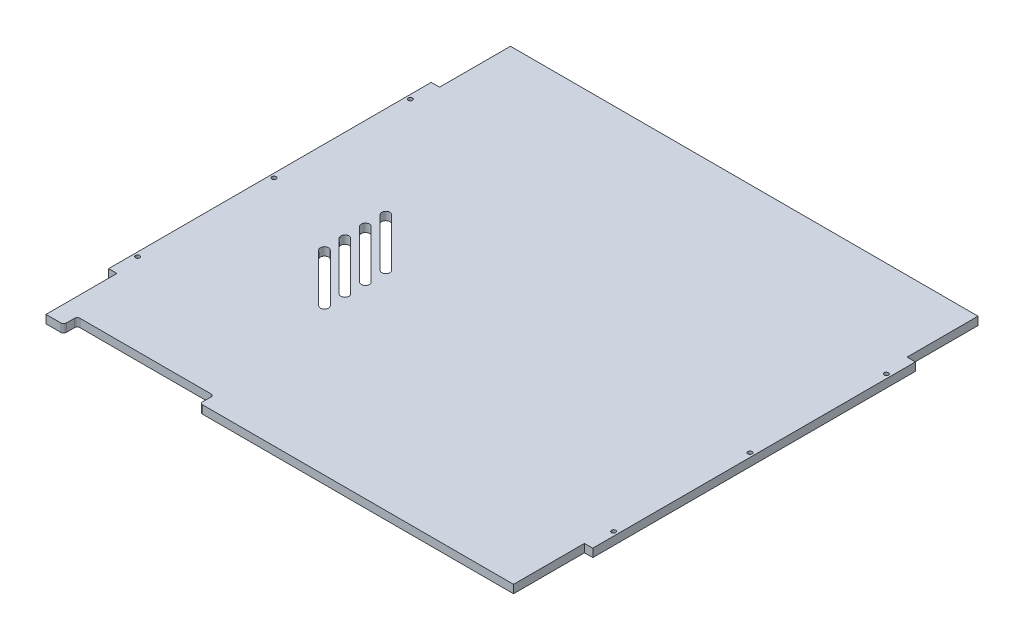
ISO-10303-21;
HEADER;
FILE_DESCRIPTION(('STEP AP214'),'2;1');
FILE_NAME('part.step','',(''),(''),'','','');
FILE_SCHEMA(('AUTOMOTIVE_DESIGN { 1 0 10303 214 1 1 1 1 }'));
ENDSEC;
DATA;
#1=APPLICATION_CONTEXT('core data for automotive mechanical design processes');
#2=APPLICATION_PROTOCOL_DEFINITION('international standard','automotive_design',2000,#1);
#3=PRODUCT_CONTEXT('',#1,'mechanical');
#4=PRODUCT('Part','Part','',(#3));
#5=PRODUCT_RELATED_PRODUCT_CATEGORY('part','',(#4));
#6=PRODUCT_DEFINITION_FORMATION('','',#4);
#7=PRODUCT_DEFINITION_CONTEXT('part definition',#1,'design');
#8=PRODUCT_DEFINITION('design','',#6,#7);
#9=PRODUCT_DEFINITION_SHAPE('','',#8);
#10=(LENGTH_UNIT() NAMED_UNIT(*) SI_UNIT(.MILLI.,.METRE.));
#11=(NAMED_UNIT(*) PLANE_ANGLE_UNIT() SI_UNIT($,.RADIAN.));
#12=(NAMED_UNIT(*) SI_UNIT($,.STERADIAN.) SOLID_ANGLE_UNIT());
#13=UNCERTAINTY_MEASURE_WITH_UNIT(LENGTH_MEASURE(1.E-05),#10,'distance_accuracy_value','');
#14=(GEOMETRIC_REPRESENTATION_CONTEXT(3) GLOBAL_UNCERTAINTY_ASSIGNED_CONTEXT((#13)) GLOBAL_UNIT_ASSIGNED_CONTEXT((#10,
#11,#12)) REPRESENTATION_CONTEXT('',''));
#15=CARTESIAN_POINT('',(0.,0.,0.));
#16=DIRECTION('',(0.,0.,1.));
#17=DIRECTION('',(1.,0.,0.));
#18=AXIS2_PLACEMENT_3D('',#15,#16,#17);
#19=CARTESIAN_POINT('',(-177.475,6.,170.25));
#20=DIRECTION('',(0.,0.,-1.));
#21=DIRECTION('',(-1.,0.,0.));
#22=AXIS2_PLACEMENT_3D('',#19,#20,#21);
#23=PLANE('',#22);
#24=DIRECTION('',(1.,0.,0.));
#25=VECTOR('',#24,1.);
#26=CARTESIAN_POINT('',(-177.475,0.,170.25));
#27=LINE('',#26,#25);
#28=CARTESIAN_POINT('',(-171.375,0.,170.25));
#29=VERTEX_POINT('',#28);
#30=CARTESIAN_POINT('',(-160.475,0.,170.25));
#31=VERTEX_POINT('',#30);
#32=EDGE_CURVE('E520',#29,#31,#27,.T.);
#33=ORIENTED_EDGE('',*,*,#32,.T.);
#34=DIRECTION('',(0.,1.,0.));
#35=VECTOR('',#34,1.);
#36=CARTESIAN_POINT('',(-160.475,6.,170.25));
#37=LINE('',#36,#35);
#38=CARTESIAN_POINT('',(-160.475,6.,170.25));
#39=VERTEX_POINT('',#38);
#40=EDGE_CURVE('E540',#31,#39,#37,.T.);
#41=ORIENTED_EDGE('',*,*,#40,.T.);
#42=DIRECTION('',(1.,0.,0.));
#43=VECTOR('',#42,1.);
#44=CARTESIAN_POINT('',(-177.475,6.,170.25));
#45=LINE('',#44,#43);
#46=CARTESIAN_POINT('',(-171.375,6.,170.25));
#47=VERTEX_POINT('',#46);
#48=EDGE_CURVE('E507',#47,#39,#45,.T.);
#49=ORIENTED_EDGE('',*,*,#48,.F.);
#50=DIRECTION('',(0.,1.,0.));
#51=VECTOR('',#50,1.);
#52=CARTESIAN_POINT('',(-171.375,0.,170.25));
#53=LINE('',#52,#51);
#54=EDGE_CURVE('E420',#29,#47,#53,.T.);
#55=ORIENTED_EDGE('',*,*,#54,.F.);
#56=EDGE_LOOP('',(#33,#41,#49,#55));
#57=FACE_BOUND('',#56,.T.);
#58=ADVANCED_FACE('F34',(#57),#23,.F.);
#59=CARTESIAN_POINT('',(-177.475,6.,-170.25));
#60=DIRECTION('',(1.,0.,0.));
#61=DIRECTION('',(0.,0.,-1.));
#62=AXIS2_PLACEMENT_3D('',#59,#60,#61);
#63=PLANE('',#62);
#64=DIRECTION('',(0.,0.,1.));
#65=VECTOR('',#64,1.);
#66=CARTESIAN_POINT('',(-177.475,0.,-170.25));
#67=LINE('',#66,#65);
#68=CARTESIAN_POINT('',(-177.475,0.,-118.25));
#69=VERTEX_POINT('',#68);
#70=CARTESIAN_POINT('',(-177.475,0.,118.25));
#71=VERTEX_POINT('',#70);
#72=EDGE_CURVE('E495',#69,#71,#67,.T.);
#73=ORIENTED_EDGE('',*,*,#72,.T.);
#74=DIRECTION('',(0.,1.,0.));
#75=VECTOR('',#74,1.);
#76=CARTESIAN_POINT('',(-177.475,0.,118.25));
#77=LINE('',#76,#75);
#78=CARTESIAN_POINT('',(-177.475,6.,118.25));
#79=VERTEX_POINT('',#78);
#80=EDGE_CURVE('E424',#71,#79,#77,.T.);
#81=ORIENTED_EDGE('',*,*,#80,.T.);
#82=DIRECTION('',(0.,0.,1.));
#83=VECTOR('',#82,1.);
#84=CARTESIAN_POINT('',(-177.475,6.,-170.25));
#85=LINE('',#84,#83);
#86=CARTESIAN_POINT('',(-177.475,6.,-118.25));
#87=VERTEX_POINT('',#86);
#88=EDGE_CURVE('E502',#87,#79,#85,.T.);
#89=ORIENTED_EDGE('',*,*,#88,.F.);
#90=DIRECTION('',(0.,1.,0.));
#91=VECTOR('',#90,1.);
#92=CARTESIAN_POINT('',(-177.475,0.,-118.25));
#93=LINE('',#92,#91);
#94=EDGE_CURVE('E438',#69,#87,#93,.T.);
#95=ORIENTED_EDGE('',*,*,#94,.F.);
#96=EDGE_LOOP('',(#73,#81,#89,#95));
#97=FACE_BOUND('',#96,.T.);
#98=ADVANCED_FACE('F594',(#97),#63,.F.);
#99=CARTESIAN_POINT('',(-56.475,6.,170.25));
#100=VERTEX_POINT('',#99);
#101=CARTESIAN_POINT('',(171.375,6.,170.25));
#102=VERTEX_POINT('',#101);
#103=EDGE_CURVE('E505',#100,#102,#45,.T.);
#104=ORIENTED_EDGE('',*,*,#103,.F.);
#105=DIRECTION('',(0.,1.,0.));
#106=VECTOR('',#105,1.);
#107=CARTESIAN_POINT('',(-56.475,6.,170.25));
#108=LINE('',#107,#106);
#109=CARTESIAN_POINT('',(-56.475,0.,170.25));
#110=VERTEX_POINT('',#109);
#111=EDGE_CURVE('E535',#100,#110,#108,.F.);
#112=ORIENTED_EDGE('',*,*,#111,.T.);
#113=CARTESIAN_POINT('',(171.375,0.,170.25));
#114=VERTEX_POINT('',#113);
#115=EDGE_CURVE('E519',#110,#114,#27,.T.);
#116=ORIENTED_EDGE('',*,*,#115,.T.);
#117=DIRECTION('',(0.,1.,0.));
#118=VECTOR('',#117,1.);
#119=CARTESIAN_POINT('',(171.375,0.,170.25));
#120=LINE('',#119,#118);
#121=EDGE_CURVE('E479',#114,#102,#120,.T.);
#122=ORIENTED_EDGE('',*,*,#121,.T.);
#123=EDGE_LOOP('',(#104,#112,#116,#122));
#124=FACE_BOUND('',#123,.T.);
#125=ADVANCED_FACE('F629',(#124),#23,.F.);
#126=CARTESIAN_POINT('',(177.475,6.,-170.25));
#127=DIRECTION('',(-1.,0.,0.));
#128=DIRECTION('',(0.,0.,1.));
#129=AXIS2_PLACEMENT_3D('',#126,#127,#128);
#130=PLANE('',#129);
#131=DIRECTION('',(0.,0.,-1.));
#132=VECTOR('',#131,1.);
#133=CARTESIAN_POINT('',(177.475,0.,-170.25));
#134=LINE('',#133,#132);
#135=CARTESIAN_POINT('',(177.475,0.,118.25));
#136=VERTEX_POINT('',#135);
#137=CARTESIAN_POINT('',(177.475,0.,-118.25));
#138=VERTEX_POINT('',#137);
#139=EDGE_CURVE('E522',#136,#138,#134,.T.);
#140=ORIENTED_EDGE('',*,*,#139,.T.);
#141=DIRECTION('',(0.,1.,0.));
#142=VECTOR('',#141,1.);
#143=CARTESIAN_POINT('',(177.475,0.,-118.25));
#144=LINE('',#143,#142);
#145=CARTESIAN_POINT('',(177.475,6.,-118.25));
#146=VERTEX_POINT('',#145);
#147=EDGE_CURVE('E460',#138,#146,#144,.T.);
#148=ORIENTED_EDGE('',*,*,#147,.T.);
#149=DIRECTION('',(0.,0.,-1.));
#150=VECTOR('',#149,1.);
#151=CARTESIAN_POINT('',(177.475,6.,-170.25));
#152=LINE('',#151,#150);
#153=CARTESIAN_POINT('',(177.475,6.,118.25));
#154=VERTEX_POINT('',#153);
#155=EDGE_CURVE('E510',#154,#146,#152,.T.);
#156=ORIENTED_EDGE('',*,*,#155,.F.);
#157=DIRECTION('',(0.,1.,0.));
#158=VECTOR('',#157,1.);
#159=CARTESIAN_POINT('',(177.475,0.,118.25));
#160=LINE('',#159,#158);
#161=EDGE_CURVE('E474',#136,#154,#160,.T.);
#162=ORIENTED_EDGE('',*,*,#161,.F.);
#163=EDGE_LOOP('',(#140,#148,#156,#162));
#164=FACE_BOUND('',#163,.T.);
#165=ADVANCED_FACE('F617',(#164),#130,.F.);
#166=CARTESIAN_POINT('',(-177.475,6.,-170.25));
#167=DIRECTION('',(0.,0.,1.));
#168=DIRECTION('',(1.,0.,0.));
#169=AXIS2_PLACEMENT_3D('',#166,#167,#168);
#170=PLANE('',#169);
#171=DIRECTION('',(-1.,0.,0.));
#172=VECTOR('',#171,1.);
#173=CARTESIAN_POINT('',(-177.475,0.,-170.25));
#174=LINE('',#173,#172);
#175=CARTESIAN_POINT('',(171.375,0.,-170.25));
#176=VERTEX_POINT('',#175);
#177=CARTESIAN_POINT('',(-171.375,0.,-170.25));
#178=VERTEX_POINT('',#177);
#179=EDGE_CURVE('E506',#176,#178,#174,.T.);
#180=ORIENTED_EDGE('',*,*,#179,.T.);
#181=DIRECTION('',(0.,1.,0.));
#182=VECTOR('',#181,1.);
#183=CARTESIAN_POINT('',(-171.375,0.,-170.25));
#184=LINE('',#183,#182);
#185=CARTESIAN_POINT('',(-171.375,6.,-170.25));
#186=VERTEX_POINT('',#185);
#187=EDGE_CURVE('E442',#178,#186,#184,.T.);
#188=ORIENTED_EDGE('',*,*,#187,.T.);
#189=DIRECTION('',(-1.,0.,0.));
#190=VECTOR('',#189,1.);
#191=CARTESIAN_POINT('',(-177.475,6.,-170.25));
#192=LINE('',#191,#190);
#193=CARTESIAN_POINT('',(171.375,6.,-170.25));
#194=VERTEX_POINT('',#193);
#195=EDGE_CURVE('E513',#194,#186,#192,.T.);
#196=ORIENTED_EDGE('',*,*,#195,.F.);
#197=DIRECTION('',(0.,1.,0.));
#198=VECTOR('',#197,1.);
#199=CARTESIAN_POINT('',(171.375,0.,-170.25));
#200=LINE('',#199,#198);
#201=EDGE_CURVE('E456',#176,#194,#200,.T.);
#202=ORIENTED_EDGE('',*,*,#201,.F.);
#203=EDGE_LOOP('',(#180,#188,#196,#202));
#204=FACE_BOUND('',#203,.T.);
#205=ADVANCED_FACE('F605',(#204),#170,.F.);
#206=CARTESIAN_POINT('',(0.,6.,0.));
#207=DIRECTION('',(0.,1.,0.));
#208=DIRECTION('',(0.,0.,1.));
#209=AXIS2_PLACEMENT_3D('',#206,#207,#208);
#210=PLANE('',#209);
#211=CARTESIAN_POINT('',(-174.475,6.,100.));
#212=DIRECTION('',(0.,1.,0.));
#213=DIRECTION('',(0.,0.,1.));
#214=AXIS2_PLACEMENT_3D('',#211,#212,#213);
#215=CIRCLE('',#214,1.54999999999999);
#216=CARTESIAN_POINT('',(-174.475,6.,101.55));
#217=VERTEX_POINT('',#216);
#218=EDGE_CURVE('E776',#217,#217,#215,.T.);
#219=ORIENTED_EDGE('',*,*,#218,.F.);
#220=EDGE_LOOP('',(#219));
#221=FACE_BOUND('',#220,.T.);
#222=CARTESIAN_POINT('',(-174.475,6.,-100.));
#223=DIRECTION('',(0.,1.,0.));
#224=DIRECTION('',(0.,0.,-1.));
#225=AXIS2_PLACEMENT_3D('',#222,#223,#224);
#226=CIRCLE('',#225,1.54999999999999);
#227=CARTESIAN_POINT('',(-174.475,6.,-101.55));
#228=VERTEX_POINT('',#227);
#229=EDGE_CURVE('E778',#228,#228,#226,.T.);
#230=ORIENTED_EDGE('',*,*,#229,.F.);
#231=EDGE_LOOP('',(#230));
#232=FACE_BOUND('',#231,.T.);
#233=CARTESIAN_POINT('',(-174.475,6.,0.));
#234=DIRECTION('',(0.,1.,0.));
#235=DIRECTION('',(0.,0.,-1.));
#236=AXIS2_PLACEMENT_3D('',#233,#234,#235);
#237=CIRCLE('',#236,1.54999999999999);
#238=CARTESIAN_POINT('',(-174.475,6.,-1.54999999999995));
#239=VERTEX_POINT('',#238);
#240=EDGE_CURVE('E784',#239,#239,#237,.T.);
#241=ORIENTED_EDGE('',*,*,#240,.F.);
#242=EDGE_LOOP('',(#241));
#243=FACE_BOUND('',#242,.T.);
#244=CARTESIAN_POINT('',(174.475,6.,100.));
#245=DIRECTION('',(0.,1.,0.));
#246=DIRECTION('',(0.,0.,-1.));
#247=AXIS2_PLACEMENT_3D('',#244,#245,#246);
#248=CIRCLE('',#247,1.54999999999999);
#249=CARTESIAN_POINT('',(174.475,6.,98.45));
#250=VERTEX_POINT('',#249);
#251=EDGE_CURVE('E790',#250,#250,#248,.T.);
#252=ORIENTED_EDGE('',*,*,#251,.F.);
#253=EDGE_LOOP('',(#252));
#254=FACE_BOUND('',#253,.T.);
#255=CARTESIAN_POINT('',(174.475,6.,0.));
#256=DIRECTION('',(0.,1.,0.));
#257=DIRECTION('',(0.,0.,1.));
#258=AXIS2_PLACEMENT_3D('',#255,#256,#257);
#259=CIRCLE('',#258,1.54999999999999);
#260=CARTESIAN_POINT('',(174.475,6.,1.54999999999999));
#261=VERTEX_POINT('',#260);
#262=EDGE_CURVE('E796',#261,#261,#259,.T.);
#263=ORIENTED_EDGE('',*,*,#262,.F.);
#264=EDGE_LOOP('',(#263));
#265=FACE_BOUND('',#264,.T.);
#266=CARTESIAN_POINT('',(174.475,6.,-100.));
#267=DIRECTION('',(0.,1.,0.));
#268=DIRECTION('',(0.,0.,1.));
#269=AXIS2_PLACEMENT_3D('',#266,#267,#268);
#270=CIRCLE('',#269,1.54999999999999);
#271=CARTESIAN_POINT('',(174.475,6.,-98.45));
#272=VERTEX_POINT('',#271);
#273=EDGE_CURVE('E300',#272,#272,#270,.T.);
#274=ORIENTED_EDGE('',*,*,#273,.F.);
#275=EDGE_LOOP('',(#274));
#276=FACE_BOUND('',#275,.T.);
#277=CARTESIAN_POINT('',(-110.152669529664,6.,27.3223304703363));
#278=DIRECTION('',(0.,1.,0.));
#279=DIRECTION('',(0.,0.,1.));
#280=AXIS2_PLACEMENT_3D('',#277,#278,#279);
#281=CIRCLE('',#280,2.99999999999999);
#282=CARTESIAN_POINT('',(-108.031349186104,6.,25.2010101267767));
#283=VERTEX_POINT('',#282);
#284=CARTESIAN_POINT('',(-112.273989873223,6.,29.4436508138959));
#285=VERTEX_POINT('',#284);
#286=EDGE_CURVE('E276',#283,#285,#281,.T.);
#287=ORIENTED_EDGE('',*,*,#286,.F.);
#288=DIRECTION('',(-0.707106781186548,0.,-0.707106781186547));
#289=VECTOR('',#288,1.);
#290=CARTESIAN_POINT('',(-108.031349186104,6.,25.2010101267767));
#291=LINE('',#290,#289);
#292=CARTESIAN_POINT('',(-72.6760101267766,6.,60.556349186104));
#293=VERTEX_POINT('',#292);
#294=EDGE_CURVE('E294',#293,#283,#291,.T.);
#295=ORIENTED_EDGE('',*,*,#294,.F.);
#296=CARTESIAN_POINT('',(-74.7973304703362,6.,62.6776695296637));
#297=DIRECTION('',(0.,1.,0.));
#298=DIRECTION('',(0.,0.,1.));
#299=AXIS2_PLACEMENT_3D('',#296,#297,#298);
#300=CIRCLE('',#299,2.99999999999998);
#301=CARTESIAN_POINT('',(-76.9186508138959,6.,64.7989898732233));
#302=VERTEX_POINT('',#301);
#303=EDGE_CURVE('E297',#302,#293,#300,.T.);
#304=ORIENTED_EDGE('',*,*,#303,.F.);
#305=DIRECTION('',(0.707106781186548,0.,0.707106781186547));
#306=VECTOR('',#305,1.);
#307=CARTESIAN_POINT('',(-112.273989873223,6.,29.4436508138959));
#308=LINE('',#307,#306);
#309=EDGE_CURVE('E306',#285,#302,#308,.T.);
#310=ORIENTED_EDGE('',*,*,#309,.F.);
#311=EDGE_LOOP('',(#287,#295,#304,#310));
#312=FACE_BOUND('',#311,.T.);
#313=CARTESIAN_POINT('',(-110.152669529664,6.,12.3223304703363));
#314=DIRECTION('',(0.,1.,0.));
#315=DIRECTION('',(0.,0.,1.));
#316=AXIS2_PLACEMENT_3D('',#313,#314,#315);
#317=CIRCLE('',#316,2.99999999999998);
#318=CARTESIAN_POINT('',(-108.031349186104,6.,10.2010101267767));
#319=VERTEX_POINT('',#318);
#320=CARTESIAN_POINT('',(-112.273989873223,6.,14.4436508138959));
#321=VERTEX_POINT('',#320);
#322=EDGE_CURVE('E313',#319,#321,#317,.T.);
#323=ORIENTED_EDGE('',*,*,#322,.F.);
#324=DIRECTION('',(-0.707106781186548,0.,-0.707106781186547));
#325=VECTOR('',#324,1.);
#326=CARTESIAN_POINT('',(-108.031349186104,6.,10.2010101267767));
#327=LINE('',#326,#325);
#328=CARTESIAN_POINT('',(-72.6760101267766,6.,45.556349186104));
#329=VERTEX_POINT('',#328);
#330=EDGE_CURVE('E321',#329,#319,#327,.T.);
#331=ORIENTED_EDGE('',*,*,#330,.F.);
#332=CARTESIAN_POINT('',(-74.7973304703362,6.,47.6776695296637));
#333=DIRECTION('',(0.,1.,0.));
#334=DIRECTION('',(0.,0.,1.));
#335=AXIS2_PLACEMENT_3D('',#332,#333,#334);
#336=CIRCLE('',#335,3.);
#337=CARTESIAN_POINT('',(-76.9186508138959,6.,49.7989898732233));
#338=VERTEX_POINT('',#337);
#339=EDGE_CURVE('E335',#338,#329,#336,.T.);
#340=ORIENTED_EDGE('',*,*,#339,.F.);
#341=DIRECTION('',(0.707106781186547,0.,0.707106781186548));
#342=VECTOR('',#341,1.);
#343=CARTESIAN_POINT('',(-112.273989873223,6.,14.4436508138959));
#344=LINE('',#343,#342);
#345=EDGE_CURVE('E332',#321,#338,#344,.T.);
#346=ORIENTED_EDGE('',*,*,#345,.F.);
#347=EDGE_LOOP('',(#323,#331,#340,#346));
#348=FACE_BOUND('',#347,.T.);
#349=CARTESIAN_POINT('',(-110.152669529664,6.,-2.67766952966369));
#350=DIRECTION('',(0.,1.,0.));
#351=DIRECTION('',(0.,0.,1.));
#352=AXIS2_PLACEMENT_3D('',#349,#350,#351);
#353=CIRCLE('',#352,2.99999999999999);
#354=CARTESIAN_POINT('',(-108.031349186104,6.,-4.79898987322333));
#355=VERTEX_POINT('',#354);
#356=CARTESIAN_POINT('',(-112.273989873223,6.,-0.556349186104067));
#357=VERTEX_POINT('',#356);
#358=EDGE_CURVE('E342',#355,#357,#353,.T.);
#359=ORIENTED_EDGE('',*,*,#358,.F.);
#360=DIRECTION('',(-0.707106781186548,0.,-0.707106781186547));
#361=VECTOR('',#360,1.);
#362=CARTESIAN_POINT('',(-108.031349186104,6.,-4.79898987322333));
#363=LINE('',#362,#361);
#364=CARTESIAN_POINT('',(-72.6760101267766,6.,30.556349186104));
#365=VERTEX_POINT('',#364);
#366=EDGE_CURVE('E353',#365,#355,#363,.T.);
#367=ORIENTED_EDGE('',*,*,#366,.F.);
#368=CARTESIAN_POINT('',(-74.7973304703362,6.,32.6776695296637));
#369=DIRECTION('',(0.,1.,0.));
#370=DIRECTION('',(0.,0.,1.));
#371=AXIS2_PLACEMENT_3D('',#368,#369,#370);
#372=CIRCLE('',#371,2.99999999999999);
#373=CARTESIAN_POINT('',(-76.9186508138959,6.,34.7989898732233));
#374=VERTEX_POINT('',#373);
#375=EDGE_CURVE('E367',#374,#365,#372,.T.);
#376=ORIENTED_EDGE('',*,*,#375,.F.);
#377=DIRECTION('',(0.707106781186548,0.,0.707106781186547));
#378=VECTOR('',#377,1.);
#379=CARTESIAN_POINT('',(-112.273989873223,6.,-0.556349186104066));
#380=LINE('',#379,#378);
#381=EDGE_CURVE('E364',#357,#374,#380,.T.);
#382=ORIENTED_EDGE('',*,*,#381,.F.);
#383=EDGE_LOOP('',(#359,#367,#376,#382));
#384=FACE_BOUND('',#383,.T.);
#385=CARTESIAN_POINT('',(-110.152669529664,6.,-17.6776695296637));
#386=DIRECTION('',(0.,1.,0.));
#387=DIRECTION('',(0.,0.,1.));
#388=AXIS2_PLACEMENT_3D('',#385,#386,#387);
#389=CIRCLE('',#388,2.99999999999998);
#390=CARTESIAN_POINT('',(-108.031349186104,6.,-19.7989898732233));
#391=VERTEX_POINT('',#390);
#392=CARTESIAN_POINT('',(-112.273989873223,6.,-15.5563491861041));
#393=VERTEX_POINT('',#392);
#394=EDGE_CURVE('E374',#391,#393,#389,.T.);
#395=ORIENTED_EDGE('',*,*,#394,.F.);
#396=DIRECTION('',(-0.707106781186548,0.,-0.707106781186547));
#397=VECTOR('',#396,1.);
#398=CARTESIAN_POINT('',(-108.031349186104,6.,-19.7989898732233));
#399=LINE('',#398,#397);
#400=CARTESIAN_POINT('',(-72.6760101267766,6.,15.5563491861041));
#401=VERTEX_POINT('',#400);
#402=EDGE_CURVE('E385',#401,#391,#399,.T.);
#403=ORIENTED_EDGE('',*,*,#402,.F.);
#404=CARTESIAN_POINT('',(-74.7973304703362,6.,17.6776695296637));
#405=DIRECTION('',(0.,1.,0.));
#406=DIRECTION('',(0.,0.,1.));
#407=AXIS2_PLACEMENT_3D('',#404,#405,#406);
#408=CIRCLE('',#407,2.99999999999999);
#409=CARTESIAN_POINT('',(-76.9186508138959,6.,19.7989898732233));
#410=VERTEX_POINT('',#409);
#411=EDGE_CURVE('E399',#410,#401,#408,.T.);
#412=ORIENTED_EDGE('',*,*,#411,.F.);
#413=DIRECTION('',(0.707106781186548,0.,0.707106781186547));
#414=VECTOR('',#413,1.);
#415=CARTESIAN_POINT('',(-112.273989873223,6.,-15.5563491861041));
#416=LINE('',#415,#414);
#417=EDGE_CURVE('E396',#393,#410,#416,.T.);
#418=ORIENTED_EDGE('',*,*,#417,.F.);
#419=EDGE_LOOP('',(#395,#403,#412,#418));
#420=FACE_BOUND('',#419,.T.);
#421=DIRECTION('',(0.,0.,-1.));
#422=VECTOR('',#421,1.);
#423=CARTESIAN_POINT('',(-58.475,6.,170.25));
#424=LINE('',#423,#422);
#425=CARTESIAN_POINT('',(-58.475,6.,168.25));
#426=VERTEX_POINT('',#425);
#427=CARTESIAN_POINT('',(-58.475,6.,162.25));
#428=VERTEX_POINT('',#427);
#429=EDGE_CURVE('E497',#426,#428,#424,.T.);
#430=ORIENTED_EDGE('',*,*,#429,.F.);
#431=CARTESIAN_POINT('',(-56.475,6.,168.25));
#432=DIRECTION('',(0.,1.,0.));
#433=DIRECTION('',(0.,0.,1.));
#434=AXIS2_PLACEMENT_3D('',#431,#432,#433);
#435=CIRCLE('',#434,2.);
#436=EDGE_CURVE('E533',#426,#100,#435,.T.);
#437=ORIENTED_EDGE('',*,*,#436,.T.);
#438=ORIENTED_EDGE('',*,*,#103,.T.);
#439=DIRECTION('',(0.,0.,1.));
#440=VECTOR('',#439,1.);
#441=CARTESIAN_POINT('',(171.375,6.,170.25));
#442=LINE('',#441,#440);
#443=CARTESIAN_POINT('',(171.375,6.,118.25));
#444=VERTEX_POINT('',#443);
#445=EDGE_CURVE('E471',#444,#102,#442,.T.);
#446=ORIENTED_EDGE('',*,*,#445,.F.);
#447=DIRECTION('',(-1.,0.,0.));
#448=VECTOR('',#447,1.);
#449=CARTESIAN_POINT('',(177.475,6.,118.25));
#450=LINE('',#449,#448);
#451=EDGE_CURVE('E463',#154,#444,#450,.T.);
#452=ORIENTED_EDGE('',*,*,#451,.F.);
#453=ORIENTED_EDGE('',*,*,#155,.T.);
#454=DIRECTION('',(1.,0.,0.));
#455=VECTOR('',#454,1.);
#456=CARTESIAN_POINT('',(177.475,6.,-118.25));
#457=LINE('',#456,#455);
#458=CARTESIAN_POINT('',(171.375,6.,-118.25));
#459=VERTEX_POINT('',#458);
#460=EDGE_CURVE('E453',#459,#146,#457,.T.);
#461=ORIENTED_EDGE('',*,*,#460,.F.);
#462=DIRECTION('',(0.,0.,1.));
#463=VECTOR('',#462,1.);
#464=CARTESIAN_POINT('',(171.375,6.,-170.25));
#465=LINE('',#464,#463);
#466=EDGE_CURVE('E445',#194,#459,#465,.T.);
#467=ORIENTED_EDGE('',*,*,#466,.F.);
#468=ORIENTED_EDGE('',*,*,#195,.T.);
#469=DIRECTION('',(0.,0.,-1.));
#470=VECTOR('',#469,1.);
#471=CARTESIAN_POINT('',(-171.375,6.,-170.25));
#472=LINE('',#471,#470);
#473=CARTESIAN_POINT('',(-171.375,6.,-118.25));
#474=VERTEX_POINT('',#473);
#475=EDGE_CURVE('E435',#474,#186,#472,.T.);
#476=ORIENTED_EDGE('',*,*,#475,.F.);
#477=DIRECTION('',(1.,0.,0.));
#478=VECTOR('',#477,1.);
#479=CARTESIAN_POINT('',(-177.475,6.,-118.25));
#480=LINE('',#479,#478);
#481=EDGE_CURVE('E427',#87,#474,#480,.T.);
#482=ORIENTED_EDGE('',*,*,#481,.F.);
#483=ORIENTED_EDGE('',*,*,#88,.T.);
#484=DIRECTION('',(-1.,0.,0.));
#485=VECTOR('',#484,1.);
#486=CARTESIAN_POINT('',(-177.475,6.,118.25));
#487=LINE('',#486,#485);
#488=CARTESIAN_POINT('',(-171.375,6.,118.25));
#489=VERTEX_POINT('',#488);
#490=EDGE_CURVE('E417',#489,#79,#487,.T.);
#491=ORIENTED_EDGE('',*,*,#490,.F.);
#492=DIRECTION('',(0.,0.,-1.));
#493=VECTOR('',#492,1.);
#494=CARTESIAN_POINT('',(-171.375,6.,170.25));
#495=LINE('',#494,#493);
#496=EDGE_CURVE('E406',#47,#489,#495,.T.);
#497=ORIENTED_EDGE('',*,*,#496,.F.);
#498=ORIENTED_EDGE('',*,*,#48,.T.);
#499=CARTESIAN_POINT('',(-160.475,6.,168.25));
#500=DIRECTION('',(0.,1.,0.));
#501=DIRECTION('',(0.,0.,1.));
#502=AXIS2_PLACEMENT_3D('',#499,#500,#501);
#503=CIRCLE('',#502,2.);
#504=CARTESIAN_POINT('',(-158.475,6.,168.25));
#505=VERTEX_POINT('',#504);
#506=EDGE_CURVE('E531',#39,#505,#503,.T.);
#507=ORIENTED_EDGE('',*,*,#506,.T.);
#508=DIRECTION('',(0.,0.,1.));
#509=VECTOR('',#508,1.);
#510=CARTESIAN_POINT('',(-158.475,6.,170.25));
#511=LINE('',#510,#509);
#512=CARTESIAN_POINT('',(-158.475,6.,162.25));
#513=VERTEX_POINT('',#512);
#514=EDGE_CURVE('E482',#513,#505,#511,.T.);
#515=ORIENTED_EDGE('',*,*,#514,.F.);
#516=CARTESIAN_POINT('',(-156.475,6.,162.25));
#517=DIRECTION('',(0.,1.,0.));
#518=DIRECTION('',(0.,0.,1.));
#519=AXIS2_PLACEMENT_3D('',#516,#517,#518);
#520=CIRCLE('',#519,2.);
#521=CARTESIAN_POINT('',(-156.475,6.,160.25));
#522=VERTEX_POINT('',#521);
#523=EDGE_CURVE('E552',#513,#522,#520,.F.);
#524=ORIENTED_EDGE('',*,*,#523,.T.);
#525=DIRECTION('',(-1.,0.,0.));
#526=VECTOR('',#525,1.);
#527=CARTESIAN_POINT('',(-158.475,6.,160.25));
#528=LINE('',#527,#526);
#529=CARTESIAN_POINT('',(-60.475,6.,160.25));
#530=VERTEX_POINT('',#529);
#531=EDGE_CURVE('E489',#530,#522,#528,.T.);
#532=ORIENTED_EDGE('',*,*,#531,.F.);
#533=CARTESIAN_POINT('',(-60.475,6.,162.25));
#534=DIRECTION('',(0.,1.,0.));
#535=DIRECTION('',(0.,0.,1.));
#536=AXIS2_PLACEMENT_3D('',#533,#534,#535);
#537=CIRCLE('',#536,2.);
#538=EDGE_CURVE('E42',#530,#428,#537,.F.);
#539=ORIENTED_EDGE('',*,*,#538,.T.);
#540=EDGE_LOOP('',(#430,#437,#438,#446,#452,#453,#461,#467,#468,#476,#482,#483,#491,#497,#498,
#507,#515,#524,#532,#539));
#541=FACE_BOUND('',#540,.T.);
#542=ADVANCED_FACE('F558',(#221,#232,#243,#254,#265,#276,#312,#348,#384,#420,#541),#210,.T.);
#543=CARTESIAN_POINT('',(0.,0.,0.));
#544=DIRECTION('',(0.,1.,0.));
#545=DIRECTION('',(0.,0.,1.));
#546=AXIS2_PLACEMENT_3D('',#543,#544,#545);
#547=PLANE('',#546);
#548=CARTESIAN_POINT('',(-174.475,0.,100.));
#549=DIRECTION('',(0.,1.,0.));
#550=DIRECTION('',(0.,0.,1.));
#551=AXIS2_PLACEMENT_3D('',#548,#549,#550);
#552=CIRCLE('',#551,1.54999999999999);
#553=CARTESIAN_POINT('',(-174.475,0.,101.55));
#554=VERTEX_POINT('',#553);
#555=EDGE_CURVE('E773',#554,#554,#552,.T.);
#556=ORIENTED_EDGE('',*,*,#555,.T.);
#557=EDGE_LOOP('',(#556));
#558=FACE_BOUND('',#557,.T.);
#559=CARTESIAN_POINT('',(-174.475,0.,-100.));
#560=DIRECTION('',(0.,1.,0.));
#561=DIRECTION('',(0.,0.,-1.));
#562=AXIS2_PLACEMENT_3D('',#559,#560,#561);
#563=CIRCLE('',#562,1.54999999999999);
#564=CARTESIAN_POINT('',(-174.475,0.,-101.55));
#565=VERTEX_POINT('',#564);
#566=EDGE_CURVE('E781',#565,#565,#563,.T.);
#567=ORIENTED_EDGE('',*,*,#566,.T.);
#568=EDGE_LOOP('',(#567));
#569=FACE_BOUND('',#568,.T.);
#570=CARTESIAN_POINT('',(-174.475,0.,0.));
#571=DIRECTION('',(0.,1.,0.));
#572=DIRECTION('',(0.,0.,-1.));
#573=AXIS2_PLACEMENT_3D('',#570,#571,#572);
#574=CIRCLE('',#573,1.54999999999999);
#575=CARTESIAN_POINT('',(-174.475,0.,-1.54999999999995));
#576=VERTEX_POINT('',#575);
#577=EDGE_CURVE('E787',#576,#576,#574,.T.);
#578=ORIENTED_EDGE('',*,*,#577,.T.);
#579=EDGE_LOOP('',(#578));
#580=FACE_BOUND('',#579,.T.);
#581=CARTESIAN_POINT('',(174.475,0.,100.));
#582=DIRECTION('',(0.,1.,0.));
#583=DIRECTION('',(0.,0.,-1.));
#584=AXIS2_PLACEMENT_3D('',#581,#582,#583);
#585=CIRCLE('',#584,1.54999999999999);
#586=CARTESIAN_POINT('',(174.475,0.,98.45));
#587=VERTEX_POINT('',#586);
#588=EDGE_CURVE('E793',#587,#587,#585,.T.);
#589=ORIENTED_EDGE('',*,*,#588,.T.);
#590=EDGE_LOOP('',(#589));
#591=FACE_BOUND('',#590,.T.);
#592=CARTESIAN_POINT('',(174.475,0.,0.));
#593=DIRECTION('',(0.,1.,0.));
#594=DIRECTION('',(0.,0.,1.));
#595=AXIS2_PLACEMENT_3D('',#592,#593,#594);
#596=CIRCLE('',#595,1.54999999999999);
#597=CARTESIAN_POINT('',(174.475,0.,1.54999999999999));
#598=VERTEX_POINT('',#597);
#599=EDGE_CURVE('E799',#598,#598,#596,.T.);
#600=ORIENTED_EDGE('',*,*,#599,.T.);
#601=EDGE_LOOP('',(#600));
#602=FACE_BOUND('',#601,.T.);
#603=CARTESIAN_POINT('',(174.475,0.,-100.));
#604=DIRECTION('',(0.,1.,0.));
#605=DIRECTION('',(0.,0.,1.));
#606=AXIS2_PLACEMENT_3D('',#603,#604,#605);
#607=CIRCLE('',#606,1.54999999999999);
#608=CARTESIAN_POINT('',(174.475,0.,-98.45));
#609=VERTEX_POINT('',#608);
#610=EDGE_CURVE('E307',#609,#609,#607,.T.);
#611=ORIENTED_EDGE('',*,*,#610,.T.);
#612=EDGE_LOOP('',(#611));
#613=FACE_BOUND('',#612,.T.);
#614=DIRECTION('',(-0.707106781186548,0.,-0.707106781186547));
#615=VECTOR('',#614,1.);
#616=CARTESIAN_POINT('',(-108.031349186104,0.,25.2010101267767));
#617=LINE('',#616,#615);
#618=CARTESIAN_POINT('',(-72.6760101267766,0.,60.556349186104));
#619=VERTEX_POINT('',#618);
#620=CARTESIAN_POINT('',(-108.031349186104,0.,25.2010101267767));
#621=VERTEX_POINT('',#620);
#622=EDGE_CURVE('E281',#619,#621,#617,.T.);
#623=ORIENTED_EDGE('',*,*,#622,.T.);
#624=CARTESIAN_POINT('',(-110.152669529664,0.,27.3223304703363));
#625=DIRECTION('',(0.,1.,0.));
#626=DIRECTION('',(0.,0.,1.));
#627=AXIS2_PLACEMENT_3D('',#624,#625,#626);
#628=CIRCLE('',#627,2.99999999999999);
#629=CARTESIAN_POINT('',(-112.273989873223,0.,29.4436508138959));
#630=VERTEX_POINT('',#629);
#631=EDGE_CURVE('E273',#621,#630,#628,.T.);
#632=ORIENTED_EDGE('',*,*,#631,.T.);
#633=DIRECTION('',(0.707106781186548,0.,0.707106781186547));
#634=VECTOR('',#633,1.);
#635=CARTESIAN_POINT('',(-112.273989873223,0.,29.4436508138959));
#636=LINE('',#635,#634);
#637=CARTESIAN_POINT('',(-76.9186508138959,0.,64.7989898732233));
#638=VERTEX_POINT('',#637);
#639=EDGE_CURVE('E285',#630,#638,#636,.T.);
#640=ORIENTED_EDGE('',*,*,#639,.T.);
#641=CARTESIAN_POINT('',(-74.7973304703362,0.,62.6776695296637));
#642=DIRECTION('',(0.,1.,0.));
#643=DIRECTION('',(0.,0.,1.));
#644=AXIS2_PLACEMENT_3D('',#641,#642,#643);
#645=CIRCLE('',#644,2.99999999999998);
#646=EDGE_CURVE('E289',#638,#619,#645,.T.);
#647=ORIENTED_EDGE('',*,*,#646,.T.);
#648=EDGE_LOOP('',(#623,#632,#640,#647));
#649=FACE_BOUND('',#648,.T.);
#650=DIRECTION('',(-0.707106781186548,0.,-0.707106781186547));
#651=VECTOR('',#650,1.);
#652=CARTESIAN_POINT('',(-108.031349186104,0.,10.2010101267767));
#653=LINE('',#652,#651);
#654=CARTESIAN_POINT('',(-72.6760101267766,0.,45.556349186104));
#655=VERTEX_POINT('',#654);
#656=CARTESIAN_POINT('',(-108.031349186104,0.,10.2010101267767));
#657=VERTEX_POINT('',#656);
#658=EDGE_CURVE('E327',#655,#657,#653,.T.);
#659=ORIENTED_EDGE('',*,*,#658,.T.);
#660=CARTESIAN_POINT('',(-110.152669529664,0.,12.3223304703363));
#661=DIRECTION('',(0.,1.,0.));
#662=DIRECTION('',(0.,0.,1.));
#663=AXIS2_PLACEMENT_3D('',#660,#661,#662);
#664=CIRCLE('',#663,2.99999999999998);
#665=CARTESIAN_POINT('',(-112.273989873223,0.,14.4436508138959));
#666=VERTEX_POINT('',#665);
#667=EDGE_CURVE('E317',#657,#666,#664,.T.);
#668=ORIENTED_EDGE('',*,*,#667,.T.);
#669=DIRECTION('',(0.707106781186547,0.,0.707106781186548));
#670=VECTOR('',#669,1.);
#671=CARTESIAN_POINT('',(-112.273989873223,0.,14.4436508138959));
#672=LINE('',#671,#670);
#673=CARTESIAN_POINT('',(-76.9186508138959,0.,49.7989898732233));
#674=VERTEX_POINT('',#673);
#675=EDGE_CURVE('E320',#666,#674,#672,.T.);
#676=ORIENTED_EDGE('',*,*,#675,.T.);
#677=CARTESIAN_POINT('',(-74.7973304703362,0.,47.6776695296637));
#678=DIRECTION('',(0.,1.,0.));
#679=DIRECTION('',(0.,0.,1.));
#680=AXIS2_PLACEMENT_3D('',#677,#678,#679);
#681=CIRCLE('',#680,3.);
#682=EDGE_CURVE('E324',#674,#655,#681,.T.);
#683=ORIENTED_EDGE('',*,*,#682,.T.);
#684=EDGE_LOOP('',(#659,#668,#676,#683));
#685=FACE_BOUND('',#684,.T.);
#686=DIRECTION('',(-0.707106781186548,0.,-0.707106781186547));
#687=VECTOR('',#686,1.);
#688=CARTESIAN_POINT('',(-108.031349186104,0.,-4.79898987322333));
#689=LINE('',#688,#687);
#690=CARTESIAN_POINT('',(-72.6760101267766,0.,30.556349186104));
#691=VERTEX_POINT('',#690);
#692=CARTESIAN_POINT('',(-108.031349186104,0.,-4.79898987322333));
#693=VERTEX_POINT('',#692);
#694=EDGE_CURVE('E359',#691,#693,#689,.T.);
#695=ORIENTED_EDGE('',*,*,#694,.T.);
#696=CARTESIAN_POINT('',(-110.152669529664,0.,-2.67766952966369));
#697=DIRECTION('',(0.,1.,0.));
#698=DIRECTION('',(0.,0.,1.));
#699=AXIS2_PLACEMENT_3D('',#696,#697,#698);
#700=CIRCLE('',#699,2.99999999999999);
#701=CARTESIAN_POINT('',(-112.273989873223,0.,-0.556349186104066));
#702=VERTEX_POINT('',#701);
#703=EDGE_CURVE('E349',#693,#702,#700,.T.);
#704=ORIENTED_EDGE('',*,*,#703,.T.);
#705=DIRECTION('',(0.707106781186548,0.,0.707106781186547));
#706=VECTOR('',#705,1.);
#707=CARTESIAN_POINT('',(-112.273989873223,0.,-0.556349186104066));
#708=LINE('',#707,#706);
#709=CARTESIAN_POINT('',(-76.9186508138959,0.,34.7989898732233));
#710=VERTEX_POINT('',#709);
#711=EDGE_CURVE('E352',#702,#710,#708,.T.);
#712=ORIENTED_EDGE('',*,*,#711,.T.);
#713=CARTESIAN_POINT('',(-74.7973304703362,0.,32.6776695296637));
#714=DIRECTION('',(0.,1.,0.));
#715=DIRECTION('',(0.,0.,1.));
#716=AXIS2_PLACEMENT_3D('',#713,#714,#715);
#717=CIRCLE('',#716,2.99999999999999);
#718=EDGE_CURVE('E356',#710,#691,#717,.T.);
#719=ORIENTED_EDGE('',*,*,#718,.T.);
#720=EDGE_LOOP('',(#695,#704,#712,#719));
#721=FACE_BOUND('',#720,.T.);
#722=DIRECTION('',(-0.707106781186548,0.,-0.707106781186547));
#723=VECTOR('',#722,1.);
#724=CARTESIAN_POINT('',(-108.031349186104,0.,-19.7989898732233));
#725=LINE('',#724,#723);
#726=CARTESIAN_POINT('',(-72.6760101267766,0.,15.5563491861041));
#727=VERTEX_POINT('',#726);
#728=CARTESIAN_POINT('',(-108.031349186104,0.,-19.7989898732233));
#729=VERTEX_POINT('',#728);
#730=EDGE_CURVE('E391',#727,#729,#725,.T.);
#731=ORIENTED_EDGE('',*,*,#730,.T.);
#732=CARTESIAN_POINT('',(-110.152669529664,0.,-17.6776695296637));
#733=DIRECTION('',(0.,1.,0.));
#734=DIRECTION('',(0.,0.,1.));
#735=AXIS2_PLACEMENT_3D('',#732,#733,#734);
#736=CIRCLE('',#735,2.99999999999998);
#737=CARTESIAN_POINT('',(-112.273989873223,0.,-15.5563491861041));
#738=VERTEX_POINT('',#737);
#739=EDGE_CURVE('E381',#729,#738,#736,.T.);
#740=ORIENTED_EDGE('',*,*,#739,.T.);
#741=DIRECTION('',(0.707106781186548,0.,0.707106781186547));
#742=VECTOR('',#741,1.);
#743=CARTESIAN_POINT('',(-112.273989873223,0.,-15.5563491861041));
#744=LINE('',#743,#742);
#745=CARTESIAN_POINT('',(-76.9186508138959,0.,19.7989898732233));
#746=VERTEX_POINT('',#745);
#747=EDGE_CURVE('E384',#738,#746,#744,.T.);
#748=ORIENTED_EDGE('',*,*,#747,.T.);
#749=CARTESIAN_POINT('',(-74.7973304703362,0.,17.6776695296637));
#750=DIRECTION('',(0.,1.,0.));
#751=DIRECTION('',(0.,0.,1.));
#752=AXIS2_PLACEMENT_3D('',#749,#750,#751);
#753=CIRCLE('',#752,2.99999999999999);
#754=EDGE_CURVE('E388',#746,#727,#753,.T.);
#755=ORIENTED_EDGE('',*,*,#754,.T.);
#756=EDGE_LOOP('',(#731,#740,#748,#755));
#757=FACE_BOUND('',#756,.T.);
#758=ORIENTED_EDGE('',*,*,#115,.F.);
#759=CARTESIAN_POINT('',(-56.475,0.,168.25));
#760=DIRECTION('',(0.,1.,0.));
#761=DIRECTION('',(0.,0.,1.));
#762=AXIS2_PLACEMENT_3D('',#759,#760,#761);
#763=CIRCLE('',#762,2.);
#764=CARTESIAN_POINT('',(-58.475,0.,168.25));
#765=VERTEX_POINT('',#764);
#766=EDGE_CURVE('E538',#110,#765,#763,.F.);
#767=ORIENTED_EDGE('',*,*,#766,.T.);
#768=DIRECTION('',(0.,0.,-1.));
#769=VECTOR('',#768,1.);
#770=CARTESIAN_POINT('',(-58.475,0.,170.25));
#771=LINE('',#770,#769);
#772=CARTESIAN_POINT('',(-58.475,0.,162.25));
#773=VERTEX_POINT('',#772);
#774=EDGE_CURVE('E488',#765,#773,#771,.T.);
#775=ORIENTED_EDGE('',*,*,#774,.T.);
#776=CARTESIAN_POINT('',(-60.475,0.,162.25));
#777=DIRECTION('',(0.,1.,0.));
#778=DIRECTION('',(0.,0.,1.));
#779=AXIS2_PLACEMENT_3D('',#776,#777,#778);
#780=CIRCLE('',#779,2.);
#781=CARTESIAN_POINT('',(-60.475,0.,160.25));
#782=VERTEX_POINT('',#781);
#783=EDGE_CURVE('E11',#773,#782,#780,.T.);
#784=ORIENTED_EDGE('',*,*,#783,.T.);
#785=DIRECTION('',(-1.,0.,0.));
#786=VECTOR('',#785,1.);
#787=CARTESIAN_POINT('',(-158.475,0.,160.25));
#788=LINE('',#787,#786);
#789=CARTESIAN_POINT('',(-156.475,0.,160.25));
#790=VERTEX_POINT('',#789);
#791=EDGE_CURVE('E492',#782,#790,#788,.T.);
#792=ORIENTED_EDGE('',*,*,#791,.T.);
#793=CARTESIAN_POINT('',(-156.475,0.,162.25));
#794=DIRECTION('',(0.,1.,0.));
#795=DIRECTION('',(0.,0.,1.));
#796=AXIS2_PLACEMENT_3D('',#793,#794,#795);
#797=CIRCLE('',#796,2.);
#798=CARTESIAN_POINT('',(-158.475,0.,162.25));
#799=VERTEX_POINT('',#798);
#800=EDGE_CURVE('E554',#790,#799,#797,.T.);
#801=ORIENTED_EDGE('',*,*,#800,.T.);
#802=DIRECTION('',(0.,0.,1.));
#803=VECTOR('',#802,1.);
#804=CARTESIAN_POINT('',(-158.475,0.,170.25));
#805=LINE('',#804,#803);
#806=CARTESIAN_POINT('',(-158.475,0.,168.25));
#807=VERTEX_POINT('',#806);
#808=EDGE_CURVE('E486',#799,#807,#805,.T.);
#809=ORIENTED_EDGE('',*,*,#808,.T.);
#810=CARTESIAN_POINT('',(-160.475,0.,168.25));
#811=DIRECTION('',(0.,1.,0.));
#812=DIRECTION('',(0.,0.,1.));
#813=AXIS2_PLACEMENT_3D('',#810,#811,#812);
#814=CIRCLE('',#813,2.);
#815=EDGE_CURVE('E49',#807,#31,#814,.F.);
#816=ORIENTED_EDGE('',*,*,#815,.T.);
#817=ORIENTED_EDGE('',*,*,#32,.F.);
#818=DIRECTION('',(0.,0.,-1.));
#819=VECTOR('',#818,1.);
#820=CARTESIAN_POINT('',(-171.375,0.,170.25));
#821=LINE('',#820,#819);
#822=CARTESIAN_POINT('',(-171.375,0.,118.25));
#823=VERTEX_POINT('',#822);
#824=EDGE_CURVE('E413',#29,#823,#821,.T.);
#825=ORIENTED_EDGE('',*,*,#824,.T.);
#826=DIRECTION('',(-1.,0.,0.));
#827=VECTOR('',#826,1.);
#828=CARTESIAN_POINT('',(-177.475,0.,118.25));
#829=LINE('',#828,#827);
#830=EDGE_CURVE('E416',#823,#71,#829,.T.);
#831=ORIENTED_EDGE('',*,*,#830,.T.);
#832=ORIENTED_EDGE('',*,*,#72,.F.);
#833=DIRECTION('',(1.,0.,0.));
#834=VECTOR('',#833,1.);
#835=CARTESIAN_POINT('',(-177.475,0.,-118.25));
#836=LINE('',#835,#834);
#837=CARTESIAN_POINT('',(-171.375,0.,-118.25));
#838=VERTEX_POINT('',#837);
#839=EDGE_CURVE('E431',#69,#838,#836,.T.);
#840=ORIENTED_EDGE('',*,*,#839,.T.);
#841=DIRECTION('',(0.,0.,-1.));
#842=VECTOR('',#841,1.);
#843=CARTESIAN_POINT('',(-171.375,0.,-170.25));
#844=LINE('',#843,#842);
#845=EDGE_CURVE('E434',#838,#178,#844,.T.);
#846=ORIENTED_EDGE('',*,*,#845,.T.);
#847=ORIENTED_EDGE('',*,*,#179,.F.);
#848=DIRECTION('',(0.,0.,1.));
#849=VECTOR('',#848,1.);
#850=CARTESIAN_POINT('',(171.375,0.,-170.25));
#851=LINE('',#850,#849);
#852=CARTESIAN_POINT('',(171.375,0.,-118.25));
#853=VERTEX_POINT('',#852);
#854=EDGE_CURVE('E449',#176,#853,#851,.T.);
#855=ORIENTED_EDGE('',*,*,#854,.T.);
#856=DIRECTION('',(1.,0.,0.));
#857=VECTOR('',#856,1.);
#858=CARTESIAN_POINT('',(177.475,0.,-118.25));
#859=LINE('',#858,#857);
#860=EDGE_CURVE('E452',#853,#138,#859,.T.);
#861=ORIENTED_EDGE('',*,*,#860,.T.);
#862=ORIENTED_EDGE('',*,*,#139,.F.);
#863=DIRECTION('',(-1.,0.,0.));
#864=VECTOR('',#863,1.);
#865=CARTESIAN_POINT('',(177.475,0.,118.25));
#866=LINE('',#865,#864);
#867=CARTESIAN_POINT('',(171.375,0.,118.25));
#868=VERTEX_POINT('',#867);
#869=EDGE_CURVE('E467',#136,#868,#866,.T.);
#870=ORIENTED_EDGE('',*,*,#869,.T.);
#871=DIRECTION('',(0.,0.,1.));
#872=VECTOR('',#871,1.);
#873=CARTESIAN_POINT('',(171.375,0.,170.25));
#874=LINE('',#873,#872);
#875=EDGE_CURVE('E470',#868,#114,#874,.T.);
#876=ORIENTED_EDGE('',*,*,#875,.T.);
#877=EDGE_LOOP('',(#758,#767,#775,#784,#792,#801,#809,#816,#817,#825,#831,#832,#840,#846,#847,
#855,#861,#862,#870,#876));
#878=FACE_BOUND('',#877,.T.);
#879=ADVANCED_FACE('F291',(#558,#569,#580,#591,#602,#613,#649,#685,#721,#757,#878),#547,.F.);
#880=CARTESIAN_POINT('',(-158.475,0.,170.25));
#881=DIRECTION('',(-1.,0.,0.));
#882=DIRECTION('',(0.,0.,1.));
#883=AXIS2_PLACEMENT_3D('',#880,#881,#882);
#884=PLANE('',#883);
#885=ORIENTED_EDGE('',*,*,#514,.T.);
#886=DIRECTION('',(0.,1.,0.));
#887=VECTOR('',#886,1.);
#888=CARTESIAN_POINT('',(-158.475,0.,168.25));
#889=LINE('',#888,#887);
#890=EDGE_CURVE('E57',#505,#807,#889,.F.);
#891=ORIENTED_EDGE('',*,*,#890,.T.);
#892=ORIENTED_EDGE('',*,*,#808,.F.);
#893=DIRECTION('',(0.,1.,0.));
#894=VECTOR('',#893,1.);
#895=CARTESIAN_POINT('',(-158.475,6.,162.25));
#896=LINE('',#895,#894);
#897=EDGE_CURVE('E543',#799,#513,#896,.T.);
#898=ORIENTED_EDGE('',*,*,#897,.T.);
#899=EDGE_LOOP('',(#885,#891,#892,#898));
#900=FACE_BOUND('',#899,.T.);
#901=ADVANCED_FACE('F576',(#900),#884,.F.);
#902=CARTESIAN_POINT('',(-158.475,0.,160.25));
#903=DIRECTION('',(0.,0.,-1.));
#904=DIRECTION('',(-1.,0.,0.));
#905=AXIS2_PLACEMENT_3D('',#902,#903,#904);
#906=PLANE('',#905);
#907=ORIENTED_EDGE('',*,*,#531,.T.);
#908=DIRECTION('',(0.,1.,0.));
#909=VECTOR('',#908,1.);
#910=CARTESIAN_POINT('',(-156.475,0.,160.25));
#911=LINE('',#910,#909);
#912=EDGE_CURVE('E550',#522,#790,#911,.F.);
#913=ORIENTED_EDGE('',*,*,#912,.T.);
#914=ORIENTED_EDGE('',*,*,#791,.F.);
#915=DIRECTION('',(0.,1.,0.));
#916=VECTOR('',#915,1.);
#917=CARTESIAN_POINT('',(-60.475,6.,160.25));
#918=LINE('',#917,#916);
#919=EDGE_CURVE('E547',#782,#530,#918,.T.);
#920=ORIENTED_EDGE('',*,*,#919,.T.);
#921=EDGE_LOOP('',(#907,#913,#914,#920));
#922=FACE_BOUND('',#921,.T.);
#923=ADVANCED_FACE('F571',(#922),#906,.F.);
#924=CARTESIAN_POINT('',(-58.475,0.,170.25));
#925=DIRECTION('',(1.,0.,0.));
#926=DIRECTION('',(0.,0.,-1.));
#927=AXIS2_PLACEMENT_3D('',#924,#925,#926);
#928=PLANE('',#927);
#929=ORIENTED_EDGE('',*,*,#774,.F.);
#930=DIRECTION('',(0.,1.,0.));
#931=VECTOR('',#930,1.);
#932=CARTESIAN_POINT('',(-58.475,0.,168.25));
#933=LINE('',#932,#931);
#934=EDGE_CURVE('E528',#765,#426,#933,.T.);
#935=ORIENTED_EDGE('',*,*,#934,.T.);
#936=ORIENTED_EDGE('',*,*,#429,.T.);
#937=DIRECTION('',(0.,1.,0.));
#938=VECTOR('',#937,1.);
#939=CARTESIAN_POINT('',(-58.475,0.,162.25));
#940=LINE('',#939,#938);
#941=EDGE_CURVE('E516',#428,#773,#940,.F.);
#942=ORIENTED_EDGE('',*,*,#941,.T.);
#943=EDGE_LOOP('',(#929,#935,#936,#942));
#944=FACE_BOUND('',#943,.T.);
#945=ADVANCED_FACE('F564',(#944),#928,.F.);
#946=CARTESIAN_POINT('',(171.375,0.,170.25));
#947=DIRECTION('',(-1.,0.,0.));
#948=DIRECTION('',(0.,0.,1.));
#949=AXIS2_PLACEMENT_3D('',#946,#947,#948);
#950=PLANE('',#949);
#951=ORIENTED_EDGE('',*,*,#445,.T.);
#952=ORIENTED_EDGE('',*,*,#121,.F.);
#953=ORIENTED_EDGE('',*,*,#875,.F.);
#954=DIRECTION('',(0.,1.,0.));
#955=VECTOR('',#954,1.);
#956=CARTESIAN_POINT('',(171.375,0.,118.25));
#957=LINE('',#956,#955);
#958=EDGE_CURVE('E483',#868,#444,#957,.T.);
#959=ORIENTED_EDGE('',*,*,#958,.T.);
#960=EDGE_LOOP('',(#951,#952,#953,#959));
#961=FACE_BOUND('',#960,.T.);
#962=ADVANCED_FACE('F625',(#961),#950,.F.);
#963=CARTESIAN_POINT('',(177.475,0.,118.25));
#964=DIRECTION('',(0.,0.,-1.));
#965=DIRECTION('',(-1.,0.,0.));
#966=AXIS2_PLACEMENT_3D('',#963,#964,#965);
#967=PLANE('',#966);
#968=ORIENTED_EDGE('',*,*,#451,.T.);
#969=ORIENTED_EDGE('',*,*,#958,.F.);
#970=ORIENTED_EDGE('',*,*,#869,.F.);
#971=ORIENTED_EDGE('',*,*,#161,.T.);
#972=EDGE_LOOP('',(#968,#969,#970,#971));
#973=FACE_BOUND('',#972,.T.);
#974=ADVANCED_FACE('F622',(#973),#967,.F.);
#975=CARTESIAN_POINT('',(177.475,0.,-118.25));
#976=DIRECTION('',(0.,0.,1.));
#977=DIRECTION('',(1.,0.,0.));
#978=AXIS2_PLACEMENT_3D('',#975,#976,#977);
#979=PLANE('',#978);
#980=ORIENTED_EDGE('',*,*,#460,.T.);
#981=ORIENTED_EDGE('',*,*,#147,.F.);
#982=ORIENTED_EDGE('',*,*,#860,.F.);
#983=DIRECTION('',(0.,1.,0.));
#984=VECTOR('',#983,1.);
#985=CARTESIAN_POINT('',(171.375,0.,-118.25));
#986=LINE('',#985,#984);
#987=EDGE_CURVE('E464',#853,#459,#986,.T.);
#988=ORIENTED_EDGE('',*,*,#987,.T.);
#989=EDGE_LOOP('',(#980,#981,#982,#988));
#990=FACE_BOUND('',#989,.T.);
#991=ADVANCED_FACE('F615',(#990),#979,.F.);
#992=CARTESIAN_POINT('',(171.375,0.,-170.25));
#993=DIRECTION('',(-1.,0.,0.));
#994=DIRECTION('',(0.,0.,1.));
#995=AXIS2_PLACEMENT_3D('',#992,#993,#994);
#996=PLANE('',#995);
#997=ORIENTED_EDGE('',*,*,#466,.T.);
#998=ORIENTED_EDGE('',*,*,#987,.F.);
#999=ORIENTED_EDGE('',*,*,#854,.F.);
#1000=ORIENTED_EDGE('',*,*,#201,.T.);
#1001=EDGE_LOOP('',(#997,#998,#999,#1000));
#1002=FACE_BOUND('',#1001,.T.);
#1003=ADVANCED_FACE('F609',(#1002),#996,.F.);
#1004=CARTESIAN_POINT('',(-171.375,0.,-170.25));
#1005=DIRECTION('',(1.,0.,0.));
#1006=DIRECTION('',(0.,0.,-1.));
#1007=AXIS2_PLACEMENT_3D('',#1004,#1005,#1006);
#1008=PLANE('',#1007);
#1009=ORIENTED_EDGE('',*,*,#475,.T.);
#1010=ORIENTED_EDGE('',*,*,#187,.F.);
#1011=ORIENTED_EDGE('',*,*,#845,.F.);
#1012=DIRECTION('',(0.,1.,0.));
#1013=VECTOR('',#1012,1.);
#1014=CARTESIAN_POINT('',(-171.375,0.,-118.25));
#1015=LINE('',#1014,#1013);
#1016=EDGE_CURVE('E446',#838,#474,#1015,.T.);
#1017=ORIENTED_EDGE('',*,*,#1016,.T.);
#1018=EDGE_LOOP('',(#1009,#1010,#1011,#1017));
#1019=FACE_BOUND('',#1018,.T.);
#1020=ADVANCED_FACE('F677',(#1019),#1008,.F.);
#1021=CARTESIAN_POINT('',(-177.475,0.,-118.25));
#1022=DIRECTION('',(0.,0.,1.));
#1023=DIRECTION('',(1.,0.,0.));
#1024=AXIS2_PLACEMENT_3D('',#1021,#1022,#1023);
#1025=PLANE('',#1024);
#1026=ORIENTED_EDGE('',*,*,#481,.T.);
#1027=ORIENTED_EDGE('',*,*,#1016,.F.);
#1028=ORIENTED_EDGE('',*,*,#839,.F.);
#1029=ORIENTED_EDGE('',*,*,#94,.T.);
#1030=EDGE_LOOP('',(#1026,#1027,#1028,#1029));
#1031=FACE_BOUND('',#1030,.T.);
#1032=ADVANCED_FACE('F600',(#1031),#1025,.F.);
#1033=CARTESIAN_POINT('',(-177.475,0.,118.25));
#1034=DIRECTION('',(0.,0.,-1.));
#1035=DIRECTION('',(-1.,0.,0.));
#1036=AXIS2_PLACEMENT_3D('',#1033,#1034,#1035);
#1037=PLANE('',#1036);
#1038=ORIENTED_EDGE('',*,*,#490,.T.);
#1039=ORIENTED_EDGE('',*,*,#80,.F.);
#1040=ORIENTED_EDGE('',*,*,#830,.F.);
#1041=DIRECTION('',(0.,1.,0.));
#1042=VECTOR('',#1041,1.);
#1043=CARTESIAN_POINT('',(-171.375,0.,118.25));
#1044=LINE('',#1043,#1042);
#1045=EDGE_CURVE('E428',#823,#489,#1044,.T.);
#1046=ORIENTED_EDGE('',*,*,#1045,.T.);
#1047=EDGE_LOOP('',(#1038,#1039,#1040,#1046));
#1048=FACE_BOUND('',#1047,.T.);
#1049=ADVANCED_FACE('F591',(#1048),#1037,.F.);
#1050=CARTESIAN_POINT('',(-171.375,0.,170.25));
#1051=DIRECTION('',(1.,0.,0.));
#1052=DIRECTION('',(0.,0.,-1.));
#1053=AXIS2_PLACEMENT_3D('',#1050,#1051,#1052);
#1054=PLANE('',#1053);
#1055=ORIENTED_EDGE('',*,*,#496,.T.);
#1056=ORIENTED_EDGE('',*,*,#1045,.F.);
#1057=ORIENTED_EDGE('',*,*,#824,.F.);
#1058=ORIENTED_EDGE('',*,*,#54,.T.);
#1059=EDGE_LOOP('',(#1055,#1056,#1057,#1058));
#1060=FACE_BOUND('',#1059,.T.);
#1061=ADVANCED_FACE('F588',(#1060),#1054,.F.);
#1062=CARTESIAN_POINT('',(-110.152669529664,0.,-17.6776695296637));
#1063=DIRECTION('',(0.,1.,0.));
#1064=DIRECTION('',(0.,0.,1.));
#1065=AXIS2_PLACEMENT_3D('',#1062,#1063,#1064);
#1066=CYLINDRICAL_SURFACE('',#1065,2.99999999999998);
#1067=ORIENTED_EDGE('',*,*,#394,.T.);
#1068=DIRECTION('',(0.,1.,0.));
#1069=VECTOR('',#1068,1.);
#1070=CARTESIAN_POINT('',(-112.273989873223,0.,-15.5563491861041));
#1071=LINE('',#1070,#1069);
#1072=EDGE_CURVE('E394',#738,#393,#1071,.T.);
#1073=ORIENTED_EDGE('',*,*,#1072,.F.);
#1074=ORIENTED_EDGE('',*,*,#739,.F.);
#1075=DIRECTION('',(0.,1.,0.));
#1076=VECTOR('',#1075,1.);
#1077=CARTESIAN_POINT('',(-108.031349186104,0.,-19.7989898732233));
#1078=LINE('',#1077,#1076);
#1079=EDGE_CURVE('E404',#729,#391,#1078,.T.);
#1080=ORIENTED_EDGE('',*,*,#1079,.T.);
#1081=EDGE_LOOP('',(#1067,#1073,#1074,#1080));
#1082=FACE_BOUND('',#1081,.T.);
#1083=ADVANCED_FACE('F686',(#1082),#1066,.F.);
#1084=CARTESIAN_POINT('',(-108.031349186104,0.,-19.7989898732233));
#1085=DIRECTION('',(0.707106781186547,0.,-0.707106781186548));
#1086=DIRECTION('',(-0.707106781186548,0.,-0.707106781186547));
#1087=AXIS2_PLACEMENT_3D('',#1084,#1085,#1086);
#1088=PLANE('',#1087);
#1089=ORIENTED_EDGE('',*,*,#402,.T.);
#1090=ORIENTED_EDGE('',*,*,#1079,.F.);
#1091=ORIENTED_EDGE('',*,*,#730,.F.);
#1092=DIRECTION('',(0.,1.,0.));
#1093=VECTOR('',#1092,1.);
#1094=CARTESIAN_POINT('',(-72.6760101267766,0.,15.5563491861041));
#1095=LINE('',#1094,#1093);
#1096=EDGE_CURVE('E407',#727,#401,#1095,.T.);
#1097=ORIENTED_EDGE('',*,*,#1096,.T.);
#1098=EDGE_LOOP('',(#1089,#1090,#1091,#1097));
#1099=FACE_BOUND('',#1098,.T.);
#1100=ADVANCED_FACE('F691',(#1099),#1088,.F.);
#1101=CARTESIAN_POINT('',(-74.7973304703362,0.,17.6776695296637));
#1102=DIRECTION('',(0.,1.,0.));
#1103=DIRECTION('',(0.,0.,1.));
#1104=AXIS2_PLACEMENT_3D('',#1101,#1102,#1103);
#1105=CYLINDRICAL_SURFACE('',#1104,2.99999999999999);
#1106=ORIENTED_EDGE('',*,*,#411,.T.);
#1107=ORIENTED_EDGE('',*,*,#1096,.F.);
#1108=ORIENTED_EDGE('',*,*,#754,.F.);
#1109=DIRECTION('',(0.,1.,0.));
#1110=VECTOR('',#1109,1.);
#1111=CARTESIAN_POINT('',(-76.9186508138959,0.,19.7989898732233));
#1112=LINE('',#1111,#1110);
#1113=EDGE_CURVE('E409',#746,#410,#1112,.T.);
#1114=ORIENTED_EDGE('',*,*,#1113,.T.);
#1115=EDGE_LOOP('',(#1106,#1107,#1108,#1114));
#1116=FACE_BOUND('',#1115,.T.);
#1117=ADVANCED_FACE('F697',(#1116),#1105,.F.);
#1118=CARTESIAN_POINT('',(-112.273989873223,0.,-15.5563491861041));
#1119=DIRECTION('',(-0.707106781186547,0.,0.707106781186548));
#1120=DIRECTION('',(0.707106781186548,0.,0.707106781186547));
#1121=AXIS2_PLACEMENT_3D('',#1118,#1119,#1120);
#1122=PLANE('',#1121);
#1123=ORIENTED_EDGE('',*,*,#417,.T.);
#1124=ORIENTED_EDGE('',*,*,#1113,.F.);
#1125=ORIENTED_EDGE('',*,*,#747,.F.);
#1126=ORIENTED_EDGE('',*,*,#1072,.T.);
#1127=EDGE_LOOP('',(#1123,#1124,#1125,#1126));
#1128=FACE_BOUND('',#1127,.T.);
#1129=ADVANCED_FACE('F693',(#1128),#1122,.F.);
#1130=CARTESIAN_POINT('',(-110.152669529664,0.,-2.67766952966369));
#1131=DIRECTION('',(0.,1.,0.));
#1132=DIRECTION('',(0.,0.,1.));
#1133=AXIS2_PLACEMENT_3D('',#1130,#1131,#1132);
#1134=CYLINDRICAL_SURFACE('',#1133,2.99999999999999);
#1135=ORIENTED_EDGE('',*,*,#358,.T.);
#1136=DIRECTION('',(0.,1.,0.));
#1137=VECTOR('',#1136,1.);
#1138=CARTESIAN_POINT('',(-112.273989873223,0.,-0.556349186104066));
#1139=LINE('',#1138,#1137);
#1140=EDGE_CURVE('E362',#702,#357,#1139,.T.);
#1141=ORIENTED_EDGE('',*,*,#1140,.F.);
#1142=ORIENTED_EDGE('',*,*,#703,.F.);
#1143=DIRECTION('',(0.,1.,0.));
#1144=VECTOR('',#1143,1.);
#1145=CARTESIAN_POINT('',(-108.031349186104,0.,-4.79898987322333));
#1146=LINE('',#1145,#1144);
#1147=EDGE_CURVE('E372',#693,#355,#1146,.T.);
#1148=ORIENTED_EDGE('',*,*,#1147,.T.);
#1149=EDGE_LOOP('',(#1135,#1141,#1142,#1148));
#1150=FACE_BOUND('',#1149,.T.);
#1151=ADVANCED_FACE('F696',(#1150),#1134,.F.);
#1152=CARTESIAN_POINT('',(-108.031349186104,0.,-4.79898987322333));
#1153=DIRECTION('',(0.707106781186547,0.,-0.707106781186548));
#1154=DIRECTION('',(-0.707106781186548,0.,-0.707106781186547));
#1155=AXIS2_PLACEMENT_3D('',#1152,#1153,#1154);
#1156=PLANE('',#1155);
#1157=ORIENTED_EDGE('',*,*,#366,.T.);
#1158=ORIENTED_EDGE('',*,*,#1147,.F.);
#1159=ORIENTED_EDGE('',*,*,#694,.F.);
#1160=DIRECTION('',(0.,1.,0.));
#1161=VECTOR('',#1160,1.);
#1162=CARTESIAN_POINT('',(-72.6760101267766,0.,30.556349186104));
#1163=LINE('',#1162,#1161);
#1164=EDGE_CURVE('E375',#691,#365,#1163,.T.);
#1165=ORIENTED_EDGE('',*,*,#1164,.T.);
#1166=EDGE_LOOP('',(#1157,#1158,#1159,#1165));
#1167=FACE_BOUND('',#1166,.T.);
#1168=ADVANCED_FACE('F707',(#1167),#1156,.F.);
#1169=CARTESIAN_POINT('',(-74.7973304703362,0.,32.6776695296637));
#1170=DIRECTION('',(0.,1.,0.));
#1171=DIRECTION('',(0.,0.,1.));
#1172=AXIS2_PLACEMENT_3D('',#1169,#1170,#1171);
#1173=CYLINDRICAL_SURFACE('',#1172,2.99999999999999);
#1174=ORIENTED_EDGE('',*,*,#375,.T.);
#1175=ORIENTED_EDGE('',*,*,#1164,.F.);
#1176=ORIENTED_EDGE('',*,*,#718,.F.);
#1177=DIRECTION('',(0.,1.,0.));
#1178=VECTOR('',#1177,1.);
#1179=CARTESIAN_POINT('',(-76.9186508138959,0.,34.7989898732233));
#1180=LINE('',#1179,#1178);
#1181=EDGE_CURVE('E377',#710,#374,#1180,.T.);
#1182=ORIENTED_EDGE('',*,*,#1181,.T.);
#1183=EDGE_LOOP('',(#1174,#1175,#1176,#1182));
#1184=FACE_BOUND('',#1183,.T.);
#1185=ADVANCED_FACE('F713',(#1184),#1173,.F.);
#1186=CARTESIAN_POINT('',(-112.273989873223,0.,-0.556349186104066));
#1187=DIRECTION('',(-0.707106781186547,0.,0.707106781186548));
#1188=DIRECTION('',(0.707106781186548,0.,0.707106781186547));
#1189=AXIS2_PLACEMENT_3D('',#1186,#1187,#1188);
#1190=PLANE('',#1189);
#1191=ORIENTED_EDGE('',*,*,#381,.T.);
#1192=ORIENTED_EDGE('',*,*,#1181,.F.);
#1193=ORIENTED_EDGE('',*,*,#711,.F.);
#1194=ORIENTED_EDGE('',*,*,#1140,.T.);
#1195=EDGE_LOOP('',(#1191,#1192,#1193,#1194));
#1196=FACE_BOUND('',#1195,.T.);
#1197=ADVANCED_FACE('F709',(#1196),#1190,.F.);
#1198=CARTESIAN_POINT('',(-110.152669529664,0.,12.3223304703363));
#1199=DIRECTION('',(0.,1.,0.));
#1200=DIRECTION('',(0.,0.,1.));
#1201=AXIS2_PLACEMENT_3D('',#1198,#1199,#1200);
#1202=CYLINDRICAL_SURFACE('',#1201,2.99999999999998);
#1203=ORIENTED_EDGE('',*,*,#322,.T.);
#1204=DIRECTION('',(0.,1.,0.));
#1205=VECTOR('',#1204,1.);
#1206=CARTESIAN_POINT('',(-112.273989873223,0.,14.4436508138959));
#1207=LINE('',#1206,#1205);
#1208=EDGE_CURVE('E330',#666,#321,#1207,.T.);
#1209=ORIENTED_EDGE('',*,*,#1208,.F.);
#1210=ORIENTED_EDGE('',*,*,#667,.F.);
#1211=DIRECTION('',(0.,1.,0.));
#1212=VECTOR('',#1211,1.);
#1213=CARTESIAN_POINT('',(-108.031349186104,0.,10.2010101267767));
#1214=LINE('',#1213,#1212);
#1215=EDGE_CURVE('E340',#657,#319,#1214,.T.);
#1216=ORIENTED_EDGE('',*,*,#1215,.T.);
#1217=EDGE_LOOP('',(#1203,#1209,#1210,#1216));
#1218=FACE_BOUND('',#1217,.T.);
#1219=ADVANCED_FACE('F712',(#1218),#1202,.F.);
#1220=CARTESIAN_POINT('',(-108.031349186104,0.,10.2010101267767));
#1221=DIRECTION('',(0.707106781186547,0.,-0.707106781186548));
#1222=DIRECTION('',(-0.707106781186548,0.,-0.707106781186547));
#1223=AXIS2_PLACEMENT_3D('',#1220,#1221,#1222);
#1224=PLANE('',#1223);
#1225=ORIENTED_EDGE('',*,*,#330,.T.);
#1226=ORIENTED_EDGE('',*,*,#1215,.F.);
#1227=ORIENTED_EDGE('',*,*,#658,.F.);
#1228=DIRECTION('',(0.,1.,0.));
#1229=VECTOR('',#1228,1.);
#1230=CARTESIAN_POINT('',(-72.6760101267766,0.,45.556349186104));
#1231=LINE('',#1230,#1229);
#1232=EDGE_CURVE('E343',#655,#329,#1231,.T.);
#1233=ORIENTED_EDGE('',*,*,#1232,.T.);
#1234=EDGE_LOOP('',(#1225,#1226,#1227,#1233));
#1235=FACE_BOUND('',#1234,.T.);
#1236=ADVANCED_FACE('F723',(#1235),#1224,.F.);
#1237=CARTESIAN_POINT('',(-74.7973304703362,0.,47.6776695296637));
#1238=DIRECTION('',(0.,1.,0.));
#1239=DIRECTION('',(0.,0.,1.));
#1240=AXIS2_PLACEMENT_3D('',#1237,#1238,#1239);
#1241=CYLINDRICAL_SURFACE('',#1240,3.);
#1242=ORIENTED_EDGE('',*,*,#339,.T.);
#1243=ORIENTED_EDGE('',*,*,#1232,.F.);
#1244=ORIENTED_EDGE('',*,*,#682,.F.);
#1245=DIRECTION('',(0.,1.,0.));
#1246=VECTOR('',#1245,1.);
#1247=CARTESIAN_POINT('',(-76.9186508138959,0.,49.7989898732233));
#1248=LINE('',#1247,#1246);
#1249=EDGE_CURVE('E345',#674,#338,#1248,.T.);
#1250=ORIENTED_EDGE('',*,*,#1249,.T.);
#1251=EDGE_LOOP('',(#1242,#1243,#1244,#1250));
#1252=FACE_BOUND('',#1251,.T.);
#1253=ADVANCED_FACE('F728',(#1252),#1241,.F.);
#1254=CARTESIAN_POINT('',(-112.273989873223,0.,14.4436508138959));
#1255=DIRECTION('',(-0.707106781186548,0.,0.707106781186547));
#1256=DIRECTION('',(0.707106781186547,0.,0.707106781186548));
#1257=AXIS2_PLACEMENT_3D('',#1254,#1255,#1256);
#1258=PLANE('',#1257);
#1259=ORIENTED_EDGE('',*,*,#345,.T.);
#1260=ORIENTED_EDGE('',*,*,#1249,.F.);
#1261=ORIENTED_EDGE('',*,*,#675,.F.);
#1262=ORIENTED_EDGE('',*,*,#1208,.T.);
#1263=EDGE_LOOP('',(#1259,#1260,#1261,#1262));
#1264=FACE_BOUND('',#1263,.T.);
#1265=ADVANCED_FACE('F725',(#1264),#1258,.F.);
#1266=CARTESIAN_POINT('',(-110.152669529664,0.,27.3223304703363));
#1267=DIRECTION('',(0.,1.,0.));
#1268=DIRECTION('',(0.,0.,1.));
#1269=AXIS2_PLACEMENT_3D('',#1266,#1267,#1268);
#1270=CYLINDRICAL_SURFACE('',#1269,2.99999999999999);
#1271=ORIENTED_EDGE('',*,*,#286,.T.);
#1272=DIRECTION('',(0.,1.,0.));
#1273=VECTOR('',#1272,1.);
#1274=CARTESIAN_POINT('',(-112.273989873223,0.,29.4436508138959));
#1275=LINE('',#1274,#1273);
#1276=EDGE_CURVE('E269',#630,#285,#1275,.T.);
#1277=ORIENTED_EDGE('',*,*,#1276,.F.);
#1278=ORIENTED_EDGE('',*,*,#631,.F.);
#1279=DIRECTION('',(0.,1.,0.));
#1280=VECTOR('',#1279,1.);
#1281=CARTESIAN_POINT('',(-108.031349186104,0.,25.2010101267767));
#1282=LINE('',#1281,#1280);
#1283=EDGE_CURVE('E311',#621,#283,#1282,.T.);
#1284=ORIENTED_EDGE('',*,*,#1283,.T.);
#1285=EDGE_LOOP('',(#1271,#1277,#1278,#1284));
#1286=FACE_BOUND('',#1285,.T.);
#1287=ADVANCED_FACE('F271',(#1286),#1270,.F.);
#1288=CARTESIAN_POINT('',(-108.031349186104,0.,25.2010101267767));
#1289=DIRECTION('',(0.707106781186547,0.,-0.707106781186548));
#1290=DIRECTION('',(-0.707106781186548,0.,-0.707106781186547));
#1291=AXIS2_PLACEMENT_3D('',#1288,#1289,#1290);
#1292=PLANE('',#1291);
#1293=ORIENTED_EDGE('',*,*,#294,.T.);
#1294=ORIENTED_EDGE('',*,*,#1283,.F.);
#1295=ORIENTED_EDGE('',*,*,#622,.F.);
#1296=DIRECTION('',(0.,1.,0.));
#1297=VECTOR('',#1296,1.);
#1298=CARTESIAN_POINT('',(-72.6760101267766,0.,60.556349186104));
#1299=LINE('',#1298,#1297);
#1300=EDGE_CURVE('E314',#619,#293,#1299,.T.);
#1301=ORIENTED_EDGE('',*,*,#1300,.T.);
#1302=EDGE_LOOP('',(#1293,#1294,#1295,#1301));
#1303=FACE_BOUND('',#1302,.T.);
#1304=ADVANCED_FACE('F737',(#1303),#1292,.F.);
#1305=CARTESIAN_POINT('',(-74.7973304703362,0.,62.6776695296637));
#1306=DIRECTION('',(0.,1.,0.));
#1307=DIRECTION('',(0.,0.,1.));
#1308=AXIS2_PLACEMENT_3D('',#1305,#1306,#1307);
#1309=CYLINDRICAL_SURFACE('',#1308,2.99999999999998);
#1310=ORIENTED_EDGE('',*,*,#303,.T.);
#1311=ORIENTED_EDGE('',*,*,#1300,.F.);
#1312=ORIENTED_EDGE('',*,*,#646,.F.);
#1313=DIRECTION('',(0.,1.,0.));
#1314=VECTOR('',#1313,1.);
#1315=CARTESIAN_POINT('',(-76.9186508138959,0.,64.7989898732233));
#1316=LINE('',#1315,#1314);
#1317=EDGE_CURVE('E280',#638,#302,#1316,.T.);
#1318=ORIENTED_EDGE('',*,*,#1317,.T.);
#1319=EDGE_LOOP('',(#1310,#1311,#1312,#1318));
#1320=FACE_BOUND('',#1319,.T.);
#1321=ADVANCED_FACE('F641',(#1320),#1309,.F.);
#1322=CARTESIAN_POINT('',(-112.273989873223,0.,29.4436508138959));
#1323=DIRECTION('',(-0.707106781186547,0.,0.707106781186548));
#1324=DIRECTION('',(0.707106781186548,0.,0.707106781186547));
#1325=AXIS2_PLACEMENT_3D('',#1322,#1323,#1324);
#1326=PLANE('',#1325);
#1327=ORIENTED_EDGE('',*,*,#309,.T.);
#1328=ORIENTED_EDGE('',*,*,#1317,.F.);
#1329=ORIENTED_EDGE('',*,*,#639,.F.);
#1330=ORIENTED_EDGE('',*,*,#1276,.T.);
#1331=EDGE_LOOP('',(#1327,#1328,#1329,#1330));
#1332=FACE_BOUND('',#1331,.T.);
#1333=ADVANCED_FACE('F286',(#1332),#1326,.F.);
#1334=CARTESIAN_POINT('',(-56.475,0.,168.25));
#1335=DIRECTION('',(0.,1.,0.));
#1336=DIRECTION('',(0.,0.,1.));
#1337=AXIS2_PLACEMENT_3D('',#1334,#1335,#1336);
#1338=CYLINDRICAL_SURFACE('',#1337,2.);
#1339=ORIENTED_EDGE('',*,*,#766,.F.);
#1340=ORIENTED_EDGE('',*,*,#111,.F.);
#1341=ORIENTED_EDGE('',*,*,#436,.F.);
#1342=ORIENTED_EDGE('',*,*,#934,.F.);
#1343=EDGE_LOOP('',(#1339,#1340,#1341,#1342));
#1344=FACE_BOUND('',#1343,.T.);
#1345=ADVANCED_FACE('F633',(#1344),#1338,.T.);
#1346=CARTESIAN_POINT('',(-160.475,6.,168.25));
#1347=DIRECTION('',(0.,1.,0.));
#1348=DIRECTION('',(0.,0.,1.));
#1349=AXIS2_PLACEMENT_3D('',#1346,#1347,#1348);
#1350=CYLINDRICAL_SURFACE('',#1349,2.);
#1351=ORIENTED_EDGE('',*,*,#815,.F.);
#1352=ORIENTED_EDGE('',*,*,#890,.F.);
#1353=ORIENTED_EDGE('',*,*,#506,.F.);
#1354=ORIENTED_EDGE('',*,*,#40,.F.);
#1355=EDGE_LOOP('',(#1351,#1352,#1353,#1354));
#1356=FACE_BOUND('',#1355,.T.);
#1357=ADVANCED_FACE('F582',(#1356),#1350,.T.);
#1358=CARTESIAN_POINT('',(-156.475,0.,162.25));
#1359=DIRECTION('',(0.,-1.,0.));
#1360=DIRECTION('',(0.,0.,-1.));
#1361=AXIS2_PLACEMENT_3D('',#1358,#1359,#1360);
#1362=CYLINDRICAL_SURFACE('',#1361,2.);
#1363=ORIENTED_EDGE('',*,*,#800,.F.);
#1364=ORIENTED_EDGE('',*,*,#912,.F.);
#1365=ORIENTED_EDGE('',*,*,#523,.F.);
#1366=ORIENTED_EDGE('',*,*,#897,.F.);
#1367=EDGE_LOOP('',(#1363,#1364,#1365,#1366));
#1368=FACE_BOUND('',#1367,.T.);
#1369=ADVANCED_FACE('F574',(#1368),#1362,.F.);
#1370=CARTESIAN_POINT('',(-60.475,0.,162.25));
#1371=DIRECTION('',(0.,-1.,0.));
#1372=DIRECTION('',(0.,0.,-1.));
#1373=AXIS2_PLACEMENT_3D('',#1370,#1371,#1372);
#1374=CYLINDRICAL_SURFACE('',#1373,2.);
#1375=ORIENTED_EDGE('',*,*,#783,.F.);
#1376=ORIENTED_EDGE('',*,*,#941,.F.);
#1377=ORIENTED_EDGE('',*,*,#538,.F.);
#1378=ORIENTED_EDGE('',*,*,#919,.F.);
#1379=EDGE_LOOP('',(#1375,#1376,#1377,#1378));
#1380=FACE_BOUND('',#1379,.T.);
#1381=ADVANCED_FACE('F36',(#1380),#1374,.F.);
#1382=CARTESIAN_POINT('',(174.475,0.,-100.));
#1383=DIRECTION('',(0.,1.,0.));
#1384=DIRECTION('',(0.,0.,1.));
#1385=AXIS2_PLACEMENT_3D('',#1382,#1383,#1384);
#1386=CYLINDRICAL_SURFACE('',#1385,1.54999999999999);
#1387=ORIENTED_EDGE('',*,*,#610,.F.);
#1388=EDGE_LOOP('',(#1387));
#1389=FACE_BOUND('',#1388,.T.);
#1390=ORIENTED_EDGE('',*,*,#273,.T.);
#1391=EDGE_LOOP('',(#1390));
#1392=FACE_BOUND('',#1391,.T.);
#1393=ADVANCED_FACE('F745',(#1389,#1392),#1386,.F.);
#1394=CARTESIAN_POINT('',(174.475,0.,0.));
#1395=DIRECTION('',(0.,1.,0.));
#1396=DIRECTION('',(0.,0.,1.));
#1397=AXIS2_PLACEMENT_3D('',#1394,#1395,#1396);
#1398=CYLINDRICAL_SURFACE('',#1397,1.54999999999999);
#1399=ORIENTED_EDGE('',*,*,#599,.F.);
#1400=EDGE_LOOP('',(#1399));
#1401=FACE_BOUND('',#1400,.T.);
#1402=ORIENTED_EDGE('',*,*,#262,.T.);
#1403=EDGE_LOOP('',(#1402));
#1404=FACE_BOUND('',#1403,.T.);
#1405=ADVANCED_FACE('F748',(#1401,#1404),#1398,.F.);
#1406=CARTESIAN_POINT('',(174.475,0.,100.));
#1407=DIRECTION('',(0.,1.,0.));
#1408=DIRECTION('',(0.,0.,1.));
#1409=AXIS2_PLACEMENT_3D('',#1406,#1407,#1408);
#1410=CYLINDRICAL_SURFACE('',#1409,1.54999999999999);
#1411=ORIENTED_EDGE('',*,*,#588,.F.);
#1412=EDGE_LOOP('',(#1411));
#1413=FACE_BOUND('',#1412,.T.);
#1414=ORIENTED_EDGE('',*,*,#251,.T.);
#1415=EDGE_LOOP('',(#1414));
#1416=FACE_BOUND('',#1415,.T.);
#1417=ADVANCED_FACE('F752',(#1413,#1416),#1410,.F.);
#1418=CARTESIAN_POINT('',(-174.475,0.,0.));
#1419=DIRECTION('',(0.,1.,0.));
#1420=DIRECTION('',(0.,0.,1.));
#1421=AXIS2_PLACEMENT_3D('',#1418,#1419,#1420);
#1422=CYLINDRICAL_SURFACE('',#1421,1.54999999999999);
#1423=ORIENTED_EDGE('',*,*,#577,.F.);
#1424=EDGE_LOOP('',(#1423));
#1425=FACE_BOUND('',#1424,.T.);
#1426=ORIENTED_EDGE('',*,*,#240,.T.);
#1427=EDGE_LOOP('',(#1426));
#1428=FACE_BOUND('',#1427,.T.);
#1429=ADVANCED_FACE('F756',(#1425,#1428),#1422,.F.);
#1430=CARTESIAN_POINT('',(-174.475,0.,-100.));
#1431=DIRECTION('',(0.,1.,0.));
#1432=DIRECTION('',(0.,0.,1.));
#1433=AXIS2_PLACEMENT_3D('',#1430,#1431,#1432);
#1434=CYLINDRICAL_SURFACE('',#1433,1.54999999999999);
#1435=ORIENTED_EDGE('',*,*,#566,.F.);
#1436=EDGE_LOOP('',(#1435));
#1437=FACE_BOUND('',#1436,.T.);
#1438=ORIENTED_EDGE('',*,*,#229,.T.);
#1439=EDGE_LOOP('',(#1438));
#1440=FACE_BOUND('',#1439,.T.);
#1441=ADVANCED_FACE('F760',(#1437,#1440),#1434,.F.);
#1442=CARTESIAN_POINT('',(-174.475,0.,100.));
#1443=DIRECTION('',(0.,1.,0.));
#1444=DIRECTION('',(0.,0.,1.));
#1445=AXIS2_PLACEMENT_3D('',#1442,#1443,#1444);
#1446=CYLINDRICAL_SURFACE('',#1445,1.54999999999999);
#1447=ORIENTED_EDGE('',*,*,#555,.F.);
#1448=EDGE_LOOP('',(#1447));
#1449=FACE_BOUND('',#1448,.T.);
#1450=ORIENTED_EDGE('',*,*,#218,.T.);
#1451=EDGE_LOOP('',(#1450));
#1452=FACE_BOUND('',#1451,.T.);
#1453=ADVANCED_FACE('F764',(#1449,#1452),#1446,.F.);
#1454=CLOSED_SHELL('',(#58,#98,#125,#165,#205,#542,#879,#901,#923,#945,#962,#974,#991,#1003,
#1020,#1032,#1049,#1061,#1083,#1100,#1117,#1129,#1151,#1168,#1185,#1197,#1219,#1236,#1253,#1265,
#1287,#1304,#1321,#1333,#1345,#1357,#1369,#1381,#1393,#1405,#1417,#1429,#1441,#1453));
#1455=MANIFOLD_SOLID_BREP('B2',#1454);
#1456=ADVANCED_BREP_SHAPE_REPRESENTATION('',(#18,#1455),#14);
#1457=SHAPE_DEFINITION_REPRESENTATION(#9,#1456);
ENDSEC;
END-ISO-10303-21;
